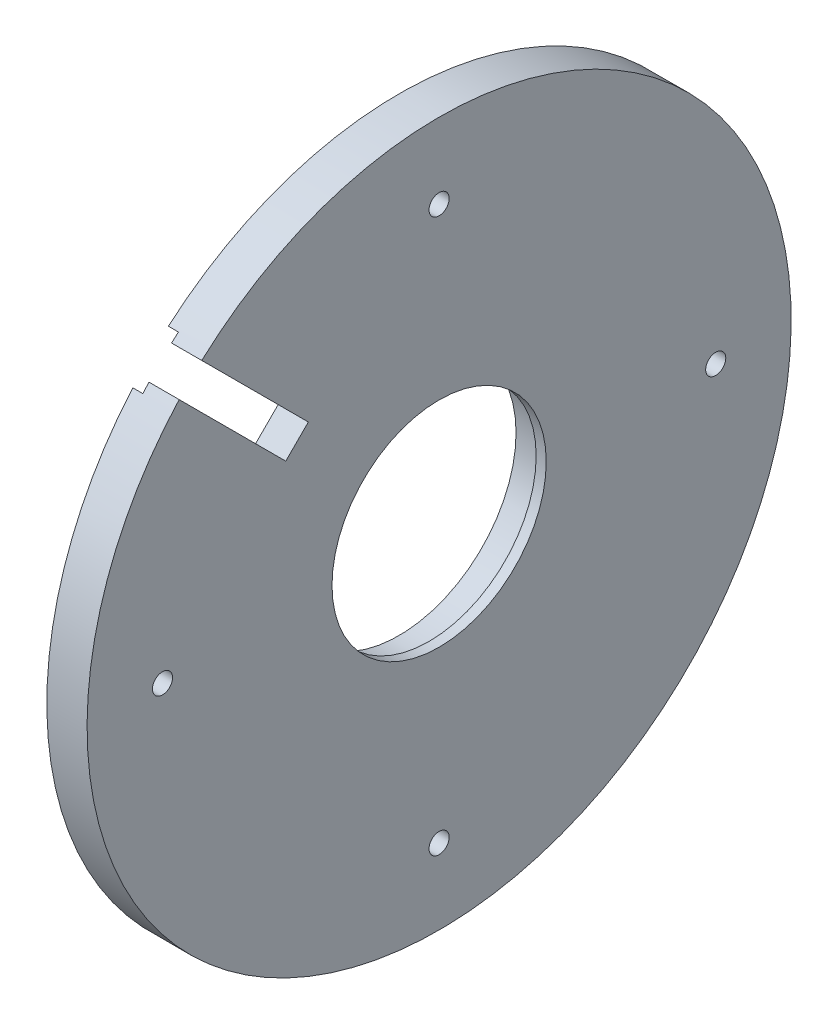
from build123d import *

# Parameters (mm, degrees)
SKETCH1_R           = 35
SKETCH1_R_2         = 11.65
BOSS_EXTRUDE1_DEPTH = 4
CUT_EXTRUDE1_DEPTH  = 10
SKETCH6_R           = 1
CUT_EXTRUDE4_DEPTH  = 10
BOSS_EXTRUDE3_START = 1
SKETCH7_R           = 11.65
SKETCH7_R_2         = 10.65
BOSS_EXTRUDE3_DEPTH = 1
SKETCH8_R           = 11.65
SKETCH8_R_2         = 11.15
CUT_EXTRUDE5_DEPTH  = 0.25
FILLET1_R           = 0.1
CUT_EXTRUDE6_DEPTH  = 1
CUT_EXTRUDE12_DEPTH = 6


with BuildPart() as part:
    # Sketch1 → Boss-Extrude1 (new body)
    with BuildSketch(Plane(origin=(0, 0, 0), x_dir=(0, -0.16775650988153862, -0.9858284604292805), z_dir=(1, 0, 0))):
        with Locations(Location((-28.542888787, 18.957113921, 0), (0, 0, 9.65740334))):
            Circle(SKETCH1_R)
        with Locations(Location((-28.542888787, 18.957113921, 0), (0, 0, 9.65740334))):
            Circle(SKETCH1_R_2, mode=Mode.SUBTRACT)
    extrude(amount=BOSS_EXTRUDE1_DEPTH)

    # Sketch2 → Cut-Extrude1 (cut)
    with BuildSketch(Plane.ZY):
        with BuildLine():
            Line((38.375552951, 38.308271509), (48.999843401, 48.932561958))
            Line((48.999843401, 48.932561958), (51.312030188, 52.930544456))
            Line((51.312030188, 52.930544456), (54.007279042, 51.111570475))
            Line((54.007279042, 51.111570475), (50.414056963, 47.518348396))
            Line((50.414056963, 47.518348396), (39.789766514, 36.894057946))
            ThreePointArc((39.789766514, 36.894057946), (39.100348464, 37.618853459), (38.375552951, 38.308271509))
        make_face()
    extrude(amount=-CUT_EXTRUDE1_DEPTH, mode=Mode.SUBTRACT)

    # Sketch6 → Cut-Extrude4 (cut)
    with BuildSketch(Plane(origin=(4, 0, 0), x_dir=(0, 0, -1), z_dir=(1, 0, 0))):
        with Locations((-24.958212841, -4.023282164)):
            Circle(SKETCH6_R)
        with Locations((2.541787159, 23.476717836)):
            Circle(SKETCH6_R)
        with Locations((-52.458212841, 23.476717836)):
            Circle(SKETCH6_R)
        with Locations((-24.958212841, 50.976717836)):
            Circle(SKETCH6_R)
    extrude(amount=-CUT_EXTRUDE4_DEPTH, mode=Mode.SUBTRACT)

    # Sketch7 → Boss-Extrude3 (add)
    with BuildSketch(Plane.ZY.offset(-4).offset(BOSS_EXTRUDE3_START)):
        with Locations((24.958212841, 23.476717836)):
            Circle(SKETCH7_R)
        with Locations((24.958212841, 23.476717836)):
            Circle(SKETCH7_R_2, mode=Mode.SUBTRACT)
    extrude(amount=-BOSS_EXTRUDE3_DEPTH)

    # Sketch8 → Cut-Extrude5 (cut)
    with BuildSketch(Plane.ZY.offset(-3)):
        with Locations((24.958212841, 23.476717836)):
            Circle(SKETCH8_R)
        with Locations((24.958212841, 23.476717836)):
            Circle(SKETCH8_R_2, mode=Mode.SUBTRACT)
    extrude(amount=-CUT_EXTRUDE5_DEPTH, mode=Mode.SUBTRACT)

    # Fillet1
    fillet1_edges = [part.edges().sort_by_distance(p)[0] for p in [
        (3.25, 23.476717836, 13.808212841),
    ]]
    fillet(fillet1_edges, radius=FILLET1_R)

    # Sketch9 → Cut-Extrude6 (cut)
    with BuildSketch(Plane.ZY):
        Polygon((36.254232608, 38.308271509), (48.989739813, 51.043778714), (52.525273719, 47.508244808), (39.789766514, 34.772737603), (39.082659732, 34.065630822), (35.547125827, 37.601164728), align=None)
        Polygon((48.989739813, 48.922458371), (50.403953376, 47.508244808), (40.402946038, 37.507237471), (38.988732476, 38.921451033), align=None, mode=Mode.SUBTRACT)
    extrude(amount=-CUT_EXTRUDE6_DEPTH, mode=Mode.SUBTRACT)

    # Sketch15 → Cut-Extrude12 (cut)
    with BuildSketch(Plane(origin=(4, 2.265244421, 47.825710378), x_dir=(0, 0, -1), z_dir=(1, 0, 0))):
        Polygon((7.620004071, 34.212873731), (9.865582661, 36.458452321), (9.847893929, 36.476141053), (-10.673980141, 56.998015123), (-12.919044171, 54.752951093), (7.602829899, 34.231077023), align=None)
    extrude(amount=-CUT_EXTRUDE12_DEPTH, mode=Mode.SUBTRACT)


solid = part.part
